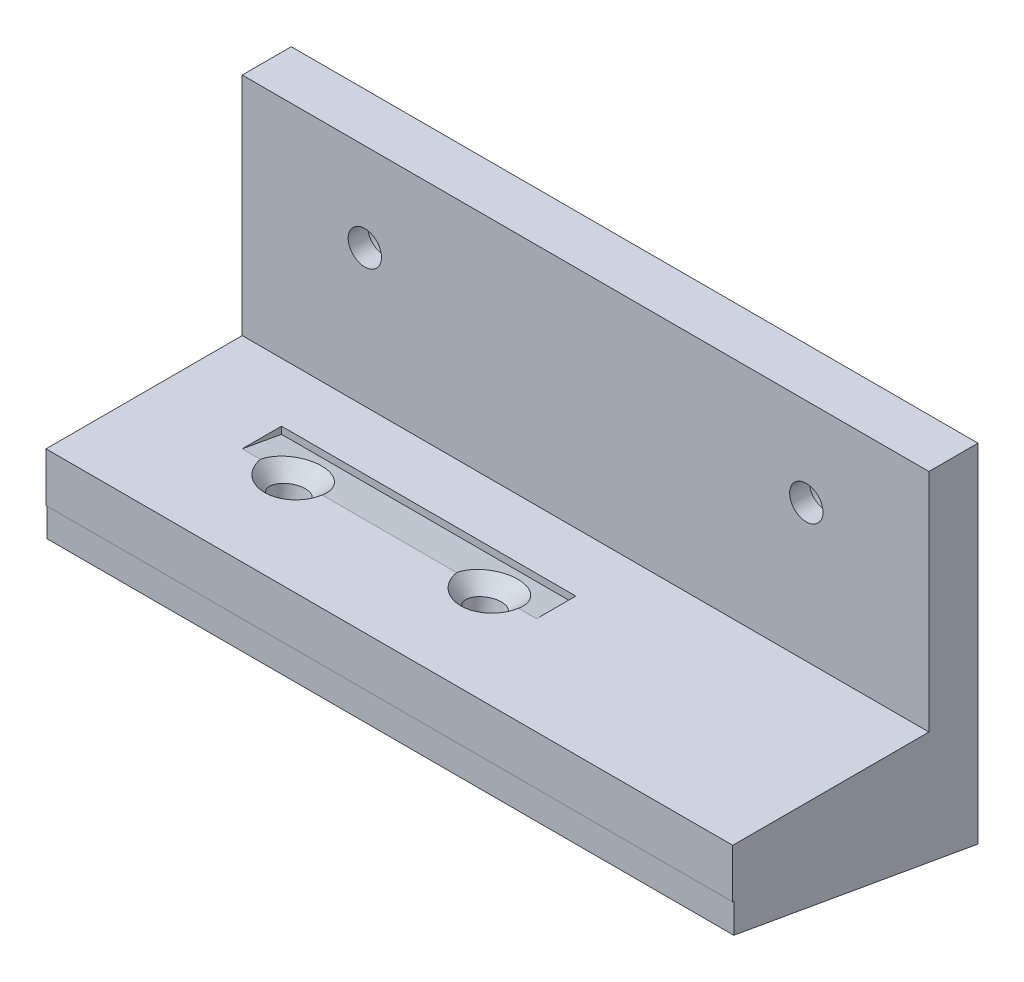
ISO-10303-21;
HEADER;
FILE_DESCRIPTION(('STEP AP214'),'2;1');
FILE_NAME('part.step','',(''),(''),'','','');
FILE_SCHEMA(('AUTOMOTIVE_DESIGN { 1 0 10303 214 1 1 1 1 }'));
ENDSEC;
DATA;
#1=APPLICATION_CONTEXT('core data for automotive mechanical design processes');
#2=APPLICATION_PROTOCOL_DEFINITION('international standard','automotive_design',2000,#1);
#3=PRODUCT_CONTEXT('',#1,'mechanical');
#4=PRODUCT('Part','Part','',(#3));
#5=PRODUCT_RELATED_PRODUCT_CATEGORY('part','',(#4));
#6=PRODUCT_DEFINITION_FORMATION('','',#4);
#7=PRODUCT_DEFINITION_CONTEXT('part definition',#1,'design');
#8=PRODUCT_DEFINITION('design','',#6,#7);
#9=PRODUCT_DEFINITION_SHAPE('','',#8);
#10=(LENGTH_UNIT() NAMED_UNIT(*) SI_UNIT(.MILLI.,.METRE.));
#11=(NAMED_UNIT(*) PLANE_ANGLE_UNIT() SI_UNIT($,.RADIAN.));
#12=(NAMED_UNIT(*) SI_UNIT($,.STERADIAN.) SOLID_ANGLE_UNIT());
#13=UNCERTAINTY_MEASURE_WITH_UNIT(LENGTH_MEASURE(1.E-05),#10,'distance_accuracy_value','');
#14=(GEOMETRIC_REPRESENTATION_CONTEXT(3) GLOBAL_UNCERTAINTY_ASSIGNED_CONTEXT((#13)) GLOBAL_UNIT_ASSIGNED_CONTEXT((#10,
#11,#12)) REPRESENTATION_CONTEXT('',''));
#15=CARTESIAN_POINT('',(0.,0.,0.));
#16=DIRECTION('',(0.,0.,1.));
#17=DIRECTION('',(1.,0.,0.));
#18=AXIS2_PLACEMENT_3D('',#15,#16,#17);
#19=CARTESIAN_POINT('',(-35.,-8.99999999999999,25.));
#20=DIRECTION('',(0.,-1.,0.));
#21=DIRECTION('',(0.,0.,-1.));
#22=AXIS2_PLACEMENT_3D('',#19,#20,#21);
#23=PLANE('',#22);
#24=DIRECTION('',(0.,0.,-1.));
#25=VECTOR('',#24,1.);
#26=CARTESIAN_POINT('',(35.,-8.99999999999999,25.));
#27=LINE('',#26,#25);
#28=CARTESIAN_POINT('',(35.,-8.99999999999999,25.));
#29=VERTEX_POINT('',#28);
#30=CARTESIAN_POINT('',(35.,-8.99999999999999,5.));
#31=VERTEX_POINT('',#30);
#32=EDGE_CURVE('E257',#29,#31,#27,.T.);
#33=ORIENTED_EDGE('',*,*,#32,.T.);
#34=DIRECTION('',(1.,0.,0.));
#35=VECTOR('',#34,1.);
#36=CARTESIAN_POINT('',(-35.,-8.99999999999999,5.));
#37=LINE('',#36,#35);
#38=CARTESIAN_POINT('',(-35.,-8.99999999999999,5.));
#39=VERTEX_POINT('',#38);
#40=EDGE_CURVE('E268',#39,#31,#37,.T.);
#41=ORIENTED_EDGE('',*,*,#40,.F.);
#42=DIRECTION('',(0.,0.,-1.));
#43=VECTOR('',#42,1.);
#44=CARTESIAN_POINT('',(-35.,-8.99999999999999,25.));
#45=LINE('',#44,#43);
#46=CARTESIAN_POINT('',(-35.,-8.99999999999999,25.));
#47=VERTEX_POINT('',#46);
#48=EDGE_CURVE('E247',#47,#39,#45,.T.);
#49=ORIENTED_EDGE('',*,*,#48,.F.);
#50=DIRECTION('',(1.,0.,0.));
#51=VECTOR('',#50,1.);
#52=CARTESIAN_POINT('',(-35.,-8.99999999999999,25.));
#53=LINE('',#52,#51);
#54=EDGE_CURVE('E256',#47,#29,#53,.T.);
#55=ORIENTED_EDGE('',*,*,#54,.T.);
#56=EDGE_LOOP('',(#33,#41,#49,#55));
#57=FACE_BOUND('',#56,.T.);
#58=DIRECTION('',(-1.,0.,0.));
#59=VECTOR('',#58,1.);
#60=CARTESIAN_POINT('',(5.,-8.99999999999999,15.));
#61=LINE('',#60,#59);
#62=CARTESIAN_POINT('',(-3.15,-8.99999999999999,15.));
#63=VERTEX_POINT('',#62);
#64=CARTESIAN_POINT('',(-16.85,-8.99999999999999,15.));
#65=VERTEX_POINT('',#64);
#66=EDGE_CURVE('E159',#63,#65,#61,.T.);
#67=ORIENTED_EDGE('',*,*,#66,.T.);
#68=CARTESIAN_POINT('',(-20.,-8.99999999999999,14.4179035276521));
#69=DIRECTION('',(0.,-1.,0.));
#70=DIRECTION('',(0.,0.,-1.));
#71=AXIS2_PLACEMENT_3D('',#68,#69,#70);
#72=ELLIPSE('',#71,3.30123314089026,3.20014093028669);
#73=CARTESIAN_POINT('',(-23.15,-8.99999999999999,15.));
#74=VERTEX_POINT('',#73);
#75=EDGE_CURVE('E52',#65,#74,#72,.T.);
#76=ORIENTED_EDGE('',*,*,#75,.T.);
#77=CARTESIAN_POINT('',(-25.,-8.99999999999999,15.));
#78=VERTEX_POINT('',#77);
#79=EDGE_CURVE('E58',#74,#78,#61,.T.);
#80=ORIENTED_EDGE('',*,*,#79,.T.);
#81=DIRECTION('',(0.,0.,1.));
#82=VECTOR('',#81,1.);
#83=CARTESIAN_POINT('',(-25.,-8.99999999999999,10.9963443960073));
#84=LINE('',#83,#82);
#85=CARTESIAN_POINT('',(-25.,-8.99999999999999,10.9963443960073));
#86=VERTEX_POINT('',#85);
#87=EDGE_CURVE('E174',#86,#78,#84,.T.);
#88=ORIENTED_EDGE('',*,*,#87,.F.);
#89=DIRECTION('',(-1.,0.,0.));
#90=VECTOR('',#89,1.);
#91=CARTESIAN_POINT('',(5.,-8.99999999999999,10.9963443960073));
#92=LINE('',#91,#90);
#93=CARTESIAN_POINT('',(5.,-8.99999999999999,10.9963443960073));
#94=VERTEX_POINT('',#93);
#95=EDGE_CURVE('E164',#94,#86,#92,.T.);
#96=ORIENTED_EDGE('',*,*,#95,.F.);
#97=DIRECTION('',(0.,0.,1.));
#98=VECTOR('',#97,1.);
#99=CARTESIAN_POINT('',(5.,-8.99999999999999,10.9963443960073));
#100=LINE('',#99,#98);
#101=CARTESIAN_POINT('',(5.,-8.99999999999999,15.));
#102=VERTEX_POINT('',#101);
#103=EDGE_CURVE('E143',#94,#102,#100,.T.);
#104=ORIENTED_EDGE('',*,*,#103,.T.);
#105=CARTESIAN_POINT('',(3.15000000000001,-8.99999999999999,15.));
#106=VERTEX_POINT('',#105);
#107=EDGE_CURVE('E151',#102,#106,#61,.T.);
#108=ORIENTED_EDGE('',*,*,#107,.T.);
#109=CARTESIAN_POINT('',(0.,-8.99999999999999,14.4179035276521));
#110=DIRECTION('',(0.,-1.,0.));
#111=DIRECTION('',(0.,0.,-1.));
#112=AXIS2_PLACEMENT_3D('',#109,#110,#111);
#113=ELLIPSE('',#112,3.30123314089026,3.20014093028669);
#114=EDGE_CURVE('E306',#106,#63,#113,.T.);
#115=ORIENTED_EDGE('',*,*,#114,.T.);
#116=EDGE_LOOP('',(#67,#76,#80,#88,#96,#104,#108,#115));
#117=FACE_BOUND('',#116,.T.);
#118=ADVANCED_FACE('F43',(#57,#117),#23,.F.);
#119=CARTESIAN_POINT('',(0.,-9.,15.));
#120=DIRECTION('',(0.,0.984807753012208,-0.173648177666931));
#121=DIRECTION('',(0.,0.173648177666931,0.984807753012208));
#122=AXIS2_PLACEMENT_3D('',#119,#120,#121);
#123=CONICAL_SURFACE('',#122,3.15,0.785398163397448);
#124=CARTESIAN_POINT('',(0.,-10.4279712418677,15.2517898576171));
#125=DIRECTION('',(0.,0.984807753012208,-0.173648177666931));
#126=DIRECTION('',(0.,0.173648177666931,0.984807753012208));
#127=AXIS2_PLACEMENT_3D('',#124,#125,#126);
#128=CIRCLE('',#127,1.7);
#129=CARTESIAN_POINT('',(0.,-10.1327693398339,16.9259630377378));
#130=VERTEX_POINT('',#129);
#131=EDGE_CURVE('E192',#130,#130,#128,.T.);
#132=ORIENTED_EDGE('',*,*,#131,.F.);
#133=EDGE_LOOP('',(#132));
#134=FACE_BOUND('',#133,.T.);
#135=CARTESIAN_POINT('',(0.,-8.99805280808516,15.0108220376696));
#136=DIRECTION('',(0.,0.984195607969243,-0.177084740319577));
#137=DIRECTION('',(0.,0.177084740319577,0.984195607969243));
#138=AXIS2_PLACEMENT_3D('',#135,#136,#137);
#139=ELLIPSE('',#138,3.15005757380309,3.15001919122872);
#140=EDGE_CURVE('E154',#63,#106,#139,.F.);
#141=ORIENTED_EDGE('',*,*,#140,.F.);
#142=ORIENTED_EDGE('',*,*,#114,.F.);
#143=EDGE_LOOP('',(#141,#142));
#144=FACE_BOUND('',#143,.T.);
#145=ADVANCED_FACE('F327',(#134,#144),#123,.F.);
#146=CARTESIAN_POINT('',(-20.,-9.,15.));
#147=DIRECTION('',(0.,0.984807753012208,-0.173648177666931));
#148=DIRECTION('',(0.,0.173648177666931,0.984807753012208));
#149=AXIS2_PLACEMENT_3D('',#146,#147,#148);
#150=CONICAL_SURFACE('',#149,3.15,0.785398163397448);
#151=CARTESIAN_POINT('',(-20.,-10.4279712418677,15.2517898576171));
#152=DIRECTION('',(0.,0.984807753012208,-0.173648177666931));
#153=DIRECTION('',(0.,0.173648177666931,0.984807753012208));
#154=AXIS2_PLACEMENT_3D('',#151,#152,#153);
#155=CIRCLE('',#154,1.7);
#156=CARTESIAN_POINT('',(-20.,-10.1327693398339,16.9259630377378));
#157=VERTEX_POINT('',#156);
#158=EDGE_CURVE('E187',#157,#157,#155,.T.);
#159=ORIENTED_EDGE('',*,*,#158,.F.);
#160=EDGE_LOOP('',(#159));
#161=FACE_BOUND('',#160,.T.);
#162=CARTESIAN_POINT('',(-20.,-8.99805280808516,15.0108220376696));
#163=DIRECTION('',(0.,0.984195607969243,-0.177084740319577));
#164=DIRECTION('',(0.,0.177084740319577,0.984195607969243));
#165=AXIS2_PLACEMENT_3D('',#162,#163,#164);
#166=ELLIPSE('',#165,3.15005757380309,3.15001919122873);
#167=EDGE_CURVE('E11',#74,#65,#166,.F.);
#168=ORIENTED_EDGE('',*,*,#167,.F.);
#169=ORIENTED_EDGE('',*,*,#75,.F.);
#170=EDGE_LOOP('',(#168,#169));
#171=FACE_BOUND('',#170,.T.);
#172=ADVANCED_FACE('F324',(#161,#171),#150,.F.);
#173=CARTESIAN_POINT('',(-35.,-14.,25.));
#174=DIRECTION('',(0.,1.,0.));
#175=DIRECTION('',(-1.,0.,0.));
#176=AXIS2_PLACEMENT_3D('',#173,#174,#175);
#177=PLANE('',#176);
#178=DIRECTION('',(-1.,0.,0.));
#179=VECTOR('',#178,1.);
#180=CARTESIAN_POINT('',(60.9611830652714,-14.,24.8876495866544));
#181=LINE('',#180,#179);
#182=CARTESIAN_POINT('',(35.,-14.,24.8876495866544));
#183=VERTEX_POINT('',#182);
#184=CARTESIAN_POINT('',(-35.,-14.,24.8876495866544));
#185=VERTEX_POINT('',#184);
#186=EDGE_CURVE('E66',#183,#185,#181,.T.);
#187=ORIENTED_EDGE('',*,*,#186,.F.);
#188=DIRECTION('',(0.,0.,-1.));
#189=VECTOR('',#188,1.);
#190=CARTESIAN_POINT('',(35.,-14.,25.));
#191=LINE('',#190,#189);
#192=CARTESIAN_POINT('',(35.,-14.,25.));
#193=VERTEX_POINT('',#192);
#194=EDGE_CURVE('E303',#193,#183,#191,.T.);
#195=ORIENTED_EDGE('',*,*,#194,.F.);
#196=DIRECTION('',(1.,0.,0.));
#197=VECTOR('',#196,1.);
#198=CARTESIAN_POINT('',(-35.,-14.,25.));
#199=LINE('',#198,#197);
#200=CARTESIAN_POINT('',(-35.,-14.,25.));
#201=VERTEX_POINT('',#200);
#202=EDGE_CURVE('E273',#201,#193,#199,.T.);
#203=ORIENTED_EDGE('',*,*,#202,.F.);
#204=DIRECTION('',(0.,0.,-1.));
#205=VECTOR('',#204,1.);
#206=CARTESIAN_POINT('',(-35.,-14.,25.));
#207=LINE('',#206,#205);
#208=EDGE_CURVE('E285',#201,#185,#207,.T.);
#209=ORIENTED_EDGE('',*,*,#208,.T.);
#210=EDGE_LOOP('',(#187,#195,#203,#209));
#211=FACE_BOUND('',#210,.T.);
#212=ADVANCED_FACE('F45',(#211),#177,.F.);
#213=CARTESIAN_POINT('',(35.,-14.,25.));
#214=DIRECTION('',(-1.,0.,0.));
#215=DIRECTION('',(0.,0.,1.));
#216=AXIS2_PLACEMENT_3D('',#213,#214,#215);
#217=PLANE('',#216);
#218=DIRECTION('',(0.,0.,-1.));
#219=VECTOR('',#218,1.);
#220=CARTESIAN_POINT('',(35.,14.,25.));
#221=LINE('',#220,#219);
#222=CARTESIAN_POINT('',(35.,14.,5.));
#223=VERTEX_POINT('',#222);
#224=CARTESIAN_POINT('',(35.,14.,0.));
#225=VERTEX_POINT('',#224);
#226=EDGE_CURVE('E300',#223,#225,#221,.T.);
#227=ORIENTED_EDGE('',*,*,#226,.F.);
#228=DIRECTION('',(0.,1.,0.));
#229=VECTOR('',#228,1.);
#230=CARTESIAN_POINT('',(35.,14.,5.));
#231=LINE('',#230,#229);
#232=EDGE_CURVE('E252',#31,#223,#231,.T.);
#233=ORIENTED_EDGE('',*,*,#232,.F.);
#234=ORIENTED_EDGE('',*,*,#32,.F.);
#235=DIRECTION('',(0.,1.,0.));
#236=VECTOR('',#235,1.);
#237=CARTESIAN_POINT('',(35.,-14.,25.));
#238=LINE('',#237,#236);
#239=EDGE_CURVE('E277',#193,#29,#238,.T.);
#240=ORIENTED_EDGE('',*,*,#239,.F.);
#241=ORIENTED_EDGE('',*,*,#194,.T.);
#242=DIRECTION('',(0.,-1.,0.));
#243=VECTOR('',#242,1.);
#244=CARTESIAN_POINT('',(35.,-14.,24.8876495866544));
#245=LINE('',#244,#243);
#246=CARTESIAN_POINT('',(35.,-17.,24.8876495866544));
#247=VERTEX_POINT('',#246);
#248=EDGE_CURVE('E201',#183,#247,#245,.T.);
#249=ORIENTED_EDGE('',*,*,#248,.T.);
#250=DIRECTION('',(0.,-0.173648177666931,-0.984807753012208));
#251=VECTOR('',#250,1.);
#252=CARTESIAN_POINT('',(35.,-17.,24.8876495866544));
#253=LINE('',#252,#251);
#254=CARTESIAN_POINT('',(35.,-21.3883641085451,0.));
#255=VERTEX_POINT('',#254);
#256=EDGE_CURVE('E197',#247,#255,#253,.T.);
#257=ORIENTED_EDGE('',*,*,#256,.T.);
#258=DIRECTION('',(0.,1.,0.));
#259=VECTOR('',#258,1.);
#260=CARTESIAN_POINT('',(35.,-14.,0.));
#261=LINE('',#260,#259);
#262=EDGE_CURVE('E267',#255,#225,#261,.T.);
#263=ORIENTED_EDGE('',*,*,#262,.T.);
#264=EDGE_LOOP('',(#227,#233,#234,#240,#241,#249,#257,#263));
#265=FACE_BOUND('',#264,.T.);
#266=ADVANCED_FACE('F397',(#265),#217,.F.);
#267=CARTESIAN_POINT('',(-35.,14.,25.));
#268=DIRECTION('',(0.,-1.,0.));
#269=DIRECTION('',(1.,0.,0.));
#270=AXIS2_PLACEMENT_3D('',#267,#268,#269);
#271=PLANE('',#270);
#272=DIRECTION('',(0.,0.,-1.));
#273=VECTOR('',#272,1.);
#274=CARTESIAN_POINT('',(-35.,14.,25.));
#275=LINE('',#274,#273);
#276=CARTESIAN_POINT('',(-35.,14.,5.));
#277=VERTEX_POINT('',#276);
#278=CARTESIAN_POINT('',(-35.,14.,0.));
#279=VERTEX_POINT('',#278);
#280=EDGE_CURVE('E297',#277,#279,#275,.T.);
#281=ORIENTED_EDGE('',*,*,#280,.F.);
#282=DIRECTION('',(1.,0.,0.));
#283=VECTOR('',#282,1.);
#284=CARTESIAN_POINT('',(-35.,14.,5.));
#285=LINE('',#284,#283);
#286=EDGE_CURVE('E263',#277,#223,#285,.T.);
#287=ORIENTED_EDGE('',*,*,#286,.T.);
#288=ORIENTED_EDGE('',*,*,#226,.T.);
#289=DIRECTION('',(-1.,0.,0.));
#290=VECTOR('',#289,1.);
#291=CARTESIAN_POINT('',(-35.,14.,0.));
#292=LINE('',#291,#290);
#293=EDGE_CURVE('E289',#225,#279,#292,.T.);
#294=ORIENTED_EDGE('',*,*,#293,.T.);
#295=EDGE_LOOP('',(#281,#287,#288,#294));
#296=FACE_BOUND('',#295,.T.);
#297=ADVANCED_FACE('F394',(#296),#271,.F.);
#298=CARTESIAN_POINT('',(-35.,-14.,25.));
#299=DIRECTION('',(1.,0.,0.));
#300=DIRECTION('',(0.,0.,-1.));
#301=AXIS2_PLACEMENT_3D('',#298,#299,#300);
#302=PLANE('',#301);
#303=ORIENTED_EDGE('',*,*,#48,.T.);
#304=DIRECTION('',(0.,1.,0.));
#305=VECTOR('',#304,1.);
#306=CARTESIAN_POINT('',(-35.,14.,5.));
#307=LINE('',#306,#305);
#308=EDGE_CURVE('E251',#39,#277,#307,.T.);
#309=ORIENTED_EDGE('',*,*,#308,.T.);
#310=ORIENTED_EDGE('',*,*,#280,.T.);
#311=DIRECTION('',(0.,-1.,0.));
#312=VECTOR('',#311,1.);
#313=CARTESIAN_POINT('',(-35.,-14.,0.));
#314=LINE('',#313,#312);
#315=CARTESIAN_POINT('',(-35.,-21.3883641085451,0.));
#316=VERTEX_POINT('',#315);
#317=EDGE_CURVE('E278',#279,#316,#314,.T.);
#318=ORIENTED_EDGE('',*,*,#317,.T.);
#319=DIRECTION('',(0.,0.173648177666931,0.984807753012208));
#320=VECTOR('',#319,1.);
#321=CARTESIAN_POINT('',(-35.,-17.,24.8876495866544));
#322=LINE('',#321,#320);
#323=CARTESIAN_POINT('',(-35.,-17.,24.8876495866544));
#324=VERTEX_POINT('',#323);
#325=EDGE_CURVE('E210',#316,#324,#322,.T.);
#326=ORIENTED_EDGE('',*,*,#325,.T.);
#327=DIRECTION('',(0.,1.,0.));
#328=VECTOR('',#327,1.);
#329=CARTESIAN_POINT('',(-35.,-14.,24.8876495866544));
#330=LINE('',#329,#328);
#331=EDGE_CURVE('E206',#324,#185,#330,.T.);
#332=ORIENTED_EDGE('',*,*,#331,.T.);
#333=ORIENTED_EDGE('',*,*,#208,.F.);
#334=DIRECTION('',(0.,-1.,0.));
#335=VECTOR('',#334,1.);
#336=CARTESIAN_POINT('',(-35.,-14.,25.));
#337=LINE('',#336,#335);
#338=EDGE_CURVE('E282',#47,#201,#337,.T.);
#339=ORIENTED_EDGE('',*,*,#338,.F.);
#340=EDGE_LOOP('',(#303,#309,#310,#318,#326,#332,#333,#339));
#341=FACE_BOUND('',#340,.T.);
#342=ADVANCED_FACE('F387',(#341),#302,.F.);
#343=CARTESIAN_POINT('',(0.,0.,25.));
#344=DIRECTION('',(0.,0.,1.));
#345=DIRECTION('',(1.,0.,0.));
#346=AXIS2_PLACEMENT_3D('',#343,#344,#345);
#347=PLANE('',#346);
#348=ORIENTED_EDGE('',*,*,#54,.F.);
#349=ORIENTED_EDGE('',*,*,#338,.T.);
#350=ORIENTED_EDGE('',*,*,#202,.T.);
#351=ORIENTED_EDGE('',*,*,#239,.T.);
#352=EDGE_LOOP('',(#348,#349,#350,#351));
#353=FACE_BOUND('',#352,.T.);
#354=ADVANCED_FACE('F384',(#353),#347,.T.);
#355=CARTESIAN_POINT('',(0.,0.,0.));
#356=DIRECTION('',(0.,0.,1.));
#357=DIRECTION('',(1.,0.,0.));
#358=AXIS2_PLACEMENT_3D('',#355,#356,#357);
#359=PLANE('',#358);
#360=CARTESIAN_POINT('',(22.5,5.,0.));
#361=DIRECTION('',(0.,0.,-1.));
#362=DIRECTION('',(-1.,0.,0.));
#363=AXIS2_PLACEMENT_3D('',#360,#361,#362);
#364=CIRCLE('',#363,3.25);
#365=CARTESIAN_POINT('',(19.25,5.,0.));
#366=VERTEX_POINT('',#365);
#367=EDGE_CURVE('E205',#366,#366,#364,.T.);
#368=ORIENTED_EDGE('',*,*,#367,.F.);
#369=EDGE_LOOP('',(#368));
#370=FACE_BOUND('',#369,.T.);
#371=CARTESIAN_POINT('',(-22.5,5.,0.));
#372=DIRECTION('',(0.,0.,-1.));
#373=DIRECTION('',(-1.,0.,0.));
#374=AXIS2_PLACEMENT_3D('',#371,#372,#373);
#375=CIRCLE('',#374,3.25);
#376=CARTESIAN_POINT('',(-25.75,5.,0.));
#377=VERTEX_POINT('',#376);
#378=EDGE_CURVE('E234',#377,#377,#375,.T.);
#379=ORIENTED_EDGE('',*,*,#378,.F.);
#380=EDGE_LOOP('',(#379));
#381=FACE_BOUND('',#380,.T.);
#382=ORIENTED_EDGE('',*,*,#262,.F.);
#383=DIRECTION('',(-1.,0.,0.));
#384=VECTOR('',#383,1.);
#385=CARTESIAN_POINT('',(60.9611830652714,-21.3883641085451,0.));
#386=LINE('',#385,#384);
#387=EDGE_CURVE('E216',#255,#316,#386,.T.);
#388=ORIENTED_EDGE('',*,*,#387,.T.);
#389=ORIENTED_EDGE('',*,*,#317,.F.);
#390=ORIENTED_EDGE('',*,*,#293,.F.);
#391=EDGE_LOOP('',(#382,#388,#389,#390));
#392=FACE_BOUND('',#391,.T.);
#393=ADVANCED_FACE('F381',(#370,#381,#392),#359,.F.);
#394=CARTESIAN_POINT('',(-35.,14.,5.));
#395=DIRECTION('',(0.,0.,-1.));
#396=DIRECTION('',(0.,1.,0.));
#397=AXIS2_PLACEMENT_3D('',#394,#395,#396);
#398=PLANE('',#397);
#399=CARTESIAN_POINT('',(22.5,5.,5.));
#400=DIRECTION('',(0.,0.,-1.));
#401=DIRECTION('',(0.,1.,0.));
#402=AXIS2_PLACEMENT_3D('',#399,#400,#401);
#403=CIRCLE('',#402,1.7);
#404=CARTESIAN_POINT('',(22.5,6.7,5.));
#405=VERTEX_POINT('',#404);
#406=EDGE_CURVE('E233',#405,#405,#403,.T.);
#407=ORIENTED_EDGE('',*,*,#406,.T.);
#408=EDGE_LOOP('',(#407));
#409=FACE_BOUND('',#408,.T.);
#410=CARTESIAN_POINT('',(-22.5,5.,5.));
#411=DIRECTION('',(0.,0.,-1.));
#412=DIRECTION('',(0.,1.,0.));
#413=AXIS2_PLACEMENT_3D('',#410,#411,#412);
#414=CIRCLE('',#413,1.7);
#415=CARTESIAN_POINT('',(-22.5,6.7,5.));
#416=VERTEX_POINT('',#415);
#417=EDGE_CURVE('E246',#416,#416,#414,.T.);
#418=ORIENTED_EDGE('',*,*,#417,.T.);
#419=EDGE_LOOP('',(#418));
#420=FACE_BOUND('',#419,.T.);
#421=ORIENTED_EDGE('',*,*,#232,.T.);
#422=ORIENTED_EDGE('',*,*,#286,.F.);
#423=ORIENTED_EDGE('',*,*,#308,.F.);
#424=ORIENTED_EDGE('',*,*,#40,.T.);
#425=EDGE_LOOP('',(#421,#422,#423,#424));
#426=FACE_BOUND('',#425,.T.);
#427=ADVANCED_FACE('F378',(#409,#420,#426),#398,.F.);
#428=CARTESIAN_POINT('',(-22.5,5.,0.));
#429=DIRECTION('',(0.,0.,-1.));
#430=DIRECTION('',(-1.,0.,0.));
#431=AXIS2_PLACEMENT_3D('',#428,#429,#430);
#432=CYLINDRICAL_SURFACE('',#431,1.7);
#433=CARTESIAN_POINT('',(-22.5,5.,3.));
#434=DIRECTION('',(0.,0.,-1.));
#435=DIRECTION('',(-1.,0.,0.));
#436=AXIS2_PLACEMENT_3D('',#433,#434,#435);
#437=CIRCLE('',#436,1.7);
#438=CARTESIAN_POINT('',(-24.2,5.,3.));
#439=VERTEX_POINT('',#438);
#440=EDGE_CURVE('E242',#439,#439,#437,.T.);
#441=ORIENTED_EDGE('',*,*,#440,.T.);
#442=EDGE_LOOP('',(#441));
#443=FACE_BOUND('',#442,.T.);
#444=ORIENTED_EDGE('',*,*,#417,.F.);
#445=EDGE_LOOP('',(#444));
#446=FACE_BOUND('',#445,.T.);
#447=ADVANCED_FACE('F374',(#443,#446),#432,.F.);
#448=CARTESIAN_POINT('',(-20.8,5.,3.));
#449=DIRECTION('',(0.,0.,1.));
#450=DIRECTION('',(1.,0.,0.));
#451=AXIS2_PLACEMENT_3D('',#448,#449,#450);
#452=PLANE('',#451);
#453=ORIENTED_EDGE('',*,*,#440,.F.);
#454=EDGE_LOOP('',(#453));
#455=FACE_BOUND('',#454,.T.);
#456=CARTESIAN_POINT('',(-22.5,5.,3.));
#457=DIRECTION('',(0.,0.,-1.));
#458=DIRECTION('',(-1.,0.,0.));
#459=AXIS2_PLACEMENT_3D('',#456,#457,#458);
#460=CIRCLE('',#459,3.25);
#461=CARTESIAN_POINT('',(-25.75,5.,3.));
#462=VERTEX_POINT('',#461);
#463=EDGE_CURVE('E238',#462,#462,#460,.T.);
#464=ORIENTED_EDGE('',*,*,#463,.T.);
#465=EDGE_LOOP('',(#464));
#466=FACE_BOUND('',#465,.T.);
#467=ADVANCED_FACE('F370',(#455,#466),#452,.F.);
#468=CARTESIAN_POINT('',(-22.5,5.,0.));
#469=DIRECTION('',(0.,0.,-1.));
#470=DIRECTION('',(-1.,0.,0.));
#471=AXIS2_PLACEMENT_3D('',#468,#469,#470);
#472=CYLINDRICAL_SURFACE('',#471,3.25);
#473=ORIENTED_EDGE('',*,*,#463,.F.);
#474=EDGE_LOOP('',(#473));
#475=FACE_BOUND('',#474,.T.);
#476=ORIENTED_EDGE('',*,*,#378,.T.);
#477=EDGE_LOOP('',(#476));
#478=FACE_BOUND('',#477,.T.);
#479=ADVANCED_FACE('F366',(#475,#478),#472,.F.);
#480=CARTESIAN_POINT('',(22.5,5.,0.));
#481=DIRECTION('',(0.,0.,-1.));
#482=DIRECTION('',(-1.,0.,0.));
#483=AXIS2_PLACEMENT_3D('',#480,#481,#482);
#484=CYLINDRICAL_SURFACE('',#483,1.7);
#485=CARTESIAN_POINT('',(22.5,5.,3.));
#486=DIRECTION('',(0.,0.,-1.));
#487=DIRECTION('',(-1.,0.,0.));
#488=AXIS2_PLACEMENT_3D('',#485,#486,#487);
#489=CIRCLE('',#488,1.7);
#490=CARTESIAN_POINT('',(20.8,5.,3.));
#491=VERTEX_POINT('',#490);
#492=EDGE_CURVE('E229',#491,#491,#489,.T.);
#493=ORIENTED_EDGE('',*,*,#492,.T.);
#494=EDGE_LOOP('',(#493));
#495=FACE_BOUND('',#494,.T.);
#496=ORIENTED_EDGE('',*,*,#406,.F.);
#497=EDGE_LOOP('',(#496));
#498=FACE_BOUND('',#497,.T.);
#499=ADVANCED_FACE('F362',(#495,#498),#484,.F.);
#500=CARTESIAN_POINT('',(24.2,5.,3.));
#501=DIRECTION('',(0.,0.,1.));
#502=DIRECTION('',(1.,0.,0.));
#503=AXIS2_PLACEMENT_3D('',#500,#501,#502);
#504=PLANE('',#503);
#505=ORIENTED_EDGE('',*,*,#492,.F.);
#506=EDGE_LOOP('',(#505));
#507=FACE_BOUND('',#506,.T.);
#508=CARTESIAN_POINT('',(22.5,5.,3.));
#509=DIRECTION('',(0.,0.,-1.));
#510=DIRECTION('',(-1.,0.,0.));
#511=AXIS2_PLACEMENT_3D('',#508,#509,#510);
#512=CIRCLE('',#511,3.25);
#513=CARTESIAN_POINT('',(19.25,5.,3.));
#514=VERTEX_POINT('',#513);
#515=EDGE_CURVE('E225',#514,#514,#512,.T.);
#516=ORIENTED_EDGE('',*,*,#515,.T.);
#517=EDGE_LOOP('',(#516));
#518=FACE_BOUND('',#517,.T.);
#519=ADVANCED_FACE('F358',(#507,#518),#504,.F.);
#520=CARTESIAN_POINT('',(22.5,5.,0.));
#521=DIRECTION('',(0.,0.,-1.));
#522=DIRECTION('',(-1.,0.,0.));
#523=AXIS2_PLACEMENT_3D('',#520,#521,#522);
#524=CYLINDRICAL_SURFACE('',#523,3.25);
#525=ORIENTED_EDGE('',*,*,#515,.F.);
#526=EDGE_LOOP('',(#525));
#527=FACE_BOUND('',#526,.T.);
#528=ORIENTED_EDGE('',*,*,#367,.T.);
#529=EDGE_LOOP('',(#528));
#530=FACE_BOUND('',#529,.T.);
#531=ADVANCED_FACE('F354',(#527,#530),#524,.F.);
#532=CARTESIAN_POINT('',(60.9611830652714,-14.,24.8876495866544));
#533=DIRECTION('',(0.,0.,1.));
#534=DIRECTION('',(0.,-1.,0.));
#535=AXIS2_PLACEMENT_3D('',#532,#533,#534);
#536=PLANE('',#535);
#537=ORIENTED_EDGE('',*,*,#248,.F.);
#538=ORIENTED_EDGE('',*,*,#186,.T.);
#539=ORIENTED_EDGE('',*,*,#331,.F.);
#540=DIRECTION('',(-1.,0.,0.));
#541=VECTOR('',#540,1.);
#542=CARTESIAN_POINT('',(60.9611830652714,-17.,24.8876495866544));
#543=LINE('',#542,#541);
#544=EDGE_CURVE('E202',#247,#324,#543,.T.);
#545=ORIENTED_EDGE('',*,*,#544,.F.);
#546=EDGE_LOOP('',(#537,#538,#539,#545));
#547=FACE_BOUND('',#546,.T.);
#548=ADVANCED_FACE('F350',(#547),#536,.T.);
#549=CARTESIAN_POINT('',(60.9611830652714,-17.,24.8876495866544));
#550=DIRECTION('',(0.,-0.984807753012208,0.173648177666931));
#551=DIRECTION('',(0.,-0.173648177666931,-0.984807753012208));
#552=AXIS2_PLACEMENT_3D('',#549,#550,#551);
#553=PLANE('',#552);
#554=CARTESIAN_POINT('',(-20.,-18.4496581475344,16.6662296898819));
#555=DIRECTION('',(0.,-0.984807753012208,0.173648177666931));
#556=DIRECTION('',(0.,-0.173648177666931,-0.984807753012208));
#557=AXIS2_PLACEMENT_3D('',#554,#555,#556);
#558=CIRCLE('',#557,1.7);
#559=CARTESIAN_POINT('',(-20.,-18.7448600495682,14.9920565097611));
#560=VERTEX_POINT('',#559);
#561=EDGE_CURVE('E191',#560,#560,#558,.T.);
#562=ORIENTED_EDGE('',*,*,#561,.F.);
#563=EDGE_LOOP('',(#562));
#564=FACE_BOUND('',#563,.T.);
#565=CARTESIAN_POINT('',(0.,-18.4496581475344,16.6662296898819));
#566=DIRECTION('',(0.,-0.984807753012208,0.173648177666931));
#567=DIRECTION('',(0.,-0.173648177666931,-0.984807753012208));
#568=AXIS2_PLACEMENT_3D('',#565,#566,#567);
#569=CIRCLE('',#568,1.7);
#570=CARTESIAN_POINT('',(0.,-18.7448600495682,14.9920565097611));
#571=VERTEX_POINT('',#570);
#572=EDGE_CURVE('E196',#571,#571,#569,.T.);
#573=ORIENTED_EDGE('',*,*,#572,.F.);
#574=EDGE_LOOP('',(#573));
#575=FACE_BOUND('',#574,.T.);
#576=ORIENTED_EDGE('',*,*,#256,.F.);
#577=ORIENTED_EDGE('',*,*,#544,.T.);
#578=ORIENTED_EDGE('',*,*,#325,.F.);
#579=ORIENTED_EDGE('',*,*,#387,.F.);
#580=EDGE_LOOP('',(#576,#577,#578,#579));
#581=FACE_BOUND('',#580,.T.);
#582=ADVANCED_FACE('F346',(#564,#575,#581),#553,.T.);
#583=CARTESIAN_POINT('',(0.,-9.,15.));
#584=DIRECTION('',(0.,0.984807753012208,-0.173648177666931));
#585=DIRECTION('',(0.,0.173648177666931,0.984807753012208));
#586=AXIS2_PLACEMENT_3D('',#583,#584,#585);
#587=CYLINDRICAL_SURFACE('',#586,1.7);
#588=ORIENTED_EDGE('',*,*,#572,.T.);
#589=EDGE_LOOP('',(#588));
#590=FACE_BOUND('',#589,.T.);
#591=ORIENTED_EDGE('',*,*,#131,.T.);
#592=EDGE_LOOP('',(#591));
#593=FACE_BOUND('',#592,.T.);
#594=ADVANCED_FACE('F343',(#590,#593),#587,.F.);
#595=CARTESIAN_POINT('',(-20.,-9.,15.));
#596=DIRECTION('',(0.,0.984807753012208,-0.173648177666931));
#597=DIRECTION('',(0.,0.173648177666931,0.984807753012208));
#598=AXIS2_PLACEMENT_3D('',#595,#596,#597);
#599=CYLINDRICAL_SURFACE('',#598,1.7);
#600=ORIENTED_EDGE('',*,*,#561,.T.);
#601=EDGE_LOOP('',(#600));
#602=FACE_BOUND('',#601,.T.);
#603=ORIENTED_EDGE('',*,*,#158,.T.);
#604=EDGE_LOOP('',(#603));
#605=FACE_BOUND('',#604,.T.);
#606=ADVANCED_FACE('F342',(#602,#605),#599,.F.);
#607=CARTESIAN_POINT('',(5.,-8.99999999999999,15.));
#608=DIRECTION('',(0.,0.984195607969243,-0.177084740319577));
#609=DIRECTION('',(0.,0.177084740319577,0.984195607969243));
#610=AXIS2_PLACEMENT_3D('',#607,#608,#609);
#611=PLANE('',#610);
#612=ORIENTED_EDGE('',*,*,#140,.T.);
#613=ORIENTED_EDGE('',*,*,#107,.F.);
#614=DIRECTION('',(0.,-0.177084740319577,-0.984195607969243));
#615=VECTOR('',#614,1.);
#616=CARTESIAN_POINT('',(5.,-8.99999999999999,15.));
#617=LINE('',#616,#615);
#618=CARTESIAN_POINT('',(5.,-9.7203713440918,10.9963443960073));
#619=VERTEX_POINT('',#618);
#620=EDGE_CURVE('E139',#102,#619,#617,.T.);
#621=ORIENTED_EDGE('',*,*,#620,.T.);
#622=DIRECTION('',(-1.,0.,0.));
#623=VECTOR('',#622,1.);
#624=CARTESIAN_POINT('',(5.,-9.7203713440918,10.9963443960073));
#625=LINE('',#624,#623);
#626=CARTESIAN_POINT('',(-25.,-9.7203713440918,10.9963443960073));
#627=VERTEX_POINT('',#626);
#628=EDGE_CURVE('E182',#619,#627,#625,.T.);
#629=ORIENTED_EDGE('',*,*,#628,.T.);
#630=DIRECTION('',(0.,-0.177084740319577,-0.984195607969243));
#631=VECTOR('',#630,1.);
#632=CARTESIAN_POINT('',(-25.,-8.99999999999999,15.));
#633=LINE('',#632,#631);
#634=EDGE_CURVE('E169',#78,#627,#633,.T.);
#635=ORIENTED_EDGE('',*,*,#634,.F.);
#636=ORIENTED_EDGE('',*,*,#79,.F.);
#637=ORIENTED_EDGE('',*,*,#167,.T.);
#638=ORIENTED_EDGE('',*,*,#66,.F.);
#639=EDGE_LOOP('',(#612,#613,#621,#629,#635,#636,#637,#638));
#640=FACE_BOUND('',#639,.T.);
#641=ADVANCED_FACE('F152',(#640),#611,.T.);
#642=CARTESIAN_POINT('',(5.,-9.7203713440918,10.9963443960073));
#643=DIRECTION('',(0.,0.,1.));
#644=DIRECTION('',(0.,-1.,0.));
#645=AXIS2_PLACEMENT_3D('',#642,#643,#644);
#646=PLANE('',#645);
#647=DIRECTION('',(0.,1.,0.));
#648=VECTOR('',#647,1.);
#649=CARTESIAN_POINT('',(-25.,-9.7203713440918,10.9963443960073));
#650=LINE('',#649,#648);
#651=EDGE_CURVE('E166',#627,#86,#650,.T.);
#652=ORIENTED_EDGE('',*,*,#651,.F.);
#653=ORIENTED_EDGE('',*,*,#628,.F.);
#654=DIRECTION('',(0.,1.,0.));
#655=VECTOR('',#654,1.);
#656=CARTESIAN_POINT('',(5.,-9.7203713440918,10.9963443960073));
#657=LINE('',#656,#655);
#658=EDGE_CURVE('E145',#619,#94,#657,.T.);
#659=ORIENTED_EDGE('',*,*,#658,.T.);
#660=ORIENTED_EDGE('',*,*,#95,.T.);
#661=EDGE_LOOP('',(#652,#653,#659,#660));
#662=FACE_BOUND('',#661,.T.);
#663=ADVANCED_FACE('F587',(#662),#646,.T.);
#664=CARTESIAN_POINT('',(5.,0.,0.));
#665=DIRECTION('',(-1.,0.,0.));
#666=DIRECTION('',(0.,0.,1.));
#667=AXIS2_PLACEMENT_3D('',#664,#665,#666);
#668=PLANE('',#667);
#669=ORIENTED_EDGE('',*,*,#103,.F.);
#670=ORIENTED_EDGE('',*,*,#658,.F.);
#671=ORIENTED_EDGE('',*,*,#620,.F.);
#672=EDGE_LOOP('',(#669,#670,#671));
#673=FACE_BOUND('',#672,.T.);
#674=ADVANCED_FACE('F141',(#673),#668,.T.);
#675=CARTESIAN_POINT('',(-25.,0.,0.));
#676=DIRECTION('',(-1.,0.,0.));
#677=DIRECTION('',(0.,0.,1.));
#678=AXIS2_PLACEMENT_3D('',#675,#676,#677);
#679=PLANE('',#678);
#680=ORIENTED_EDGE('',*,*,#87,.T.);
#681=ORIENTED_EDGE('',*,*,#634,.T.);
#682=ORIENTED_EDGE('',*,*,#651,.T.);
#683=EDGE_LOOP('',(#680,#681,#682));
#684=FACE_BOUND('',#683,.T.);
#685=ADVANCED_FACE('F600',(#684),#679,.F.);
#686=CLOSED_SHELL('',(#118,#145,#172,#212,#266,#297,#342,#354,#393,#427,#447,#467,#479,#499,
#519,#531,#548,#582,#594,#606,#641,#663,#674,#685));
#687=MANIFOLD_SOLID_BREP('B2',#686);
#688=ADVANCED_BREP_SHAPE_REPRESENTATION('',(#18,#687),#14);
#689=SHAPE_DEFINITION_REPRESENTATION(#9,#688);
ENDSEC;
END-ISO-10303-21;
